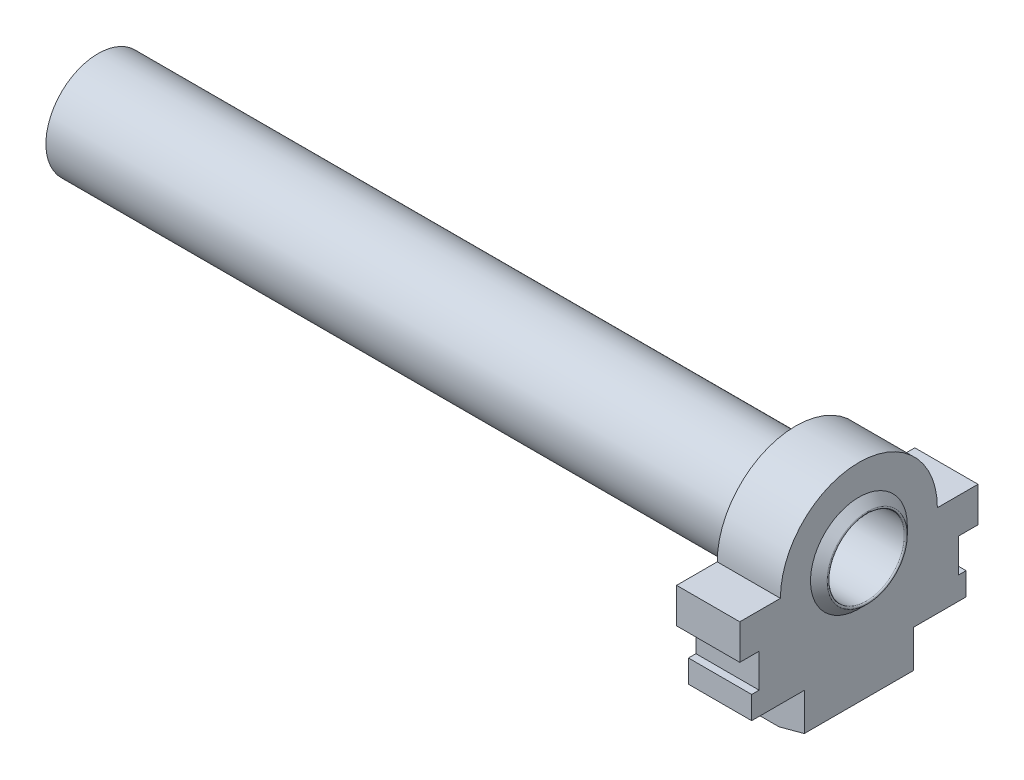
ISO-10303-21;
HEADER;
FILE_DESCRIPTION(('STEP AP214'),'2;1');
FILE_NAME('part.step','',(''),(''),'','','');
FILE_SCHEMA(('AUTOMOTIVE_DESIGN { 1 0 10303 214 1 1 1 1 }'));
ENDSEC;
DATA;
#1=APPLICATION_CONTEXT('core data for automotive mechanical design processes');
#2=APPLICATION_PROTOCOL_DEFINITION('international standard','automotive_design',2000,#1);
#3=PRODUCT_CONTEXT('',#1,'mechanical');
#4=PRODUCT('Part','Part','',(#3));
#5=PRODUCT_RELATED_PRODUCT_CATEGORY('part','',(#4));
#6=PRODUCT_DEFINITION_FORMATION('','',#4);
#7=PRODUCT_DEFINITION_CONTEXT('part definition',#1,'design');
#8=PRODUCT_DEFINITION('design','',#6,#7);
#9=PRODUCT_DEFINITION_SHAPE('','',#8);
#10=(LENGTH_UNIT() NAMED_UNIT(*) SI_UNIT(.MILLI.,.METRE.));
#11=(NAMED_UNIT(*) PLANE_ANGLE_UNIT() SI_UNIT($,.RADIAN.));
#12=(NAMED_UNIT(*) SI_UNIT($,.STERADIAN.) SOLID_ANGLE_UNIT());
#13=UNCERTAINTY_MEASURE_WITH_UNIT(LENGTH_MEASURE(1.E-05),#10,'distance_accuracy_value','');
#14=(GEOMETRIC_REPRESENTATION_CONTEXT(3) GLOBAL_UNCERTAINTY_ASSIGNED_CONTEXT((#13)) GLOBAL_UNIT_ASSIGNED_CONTEXT((#10,
#11,#12)) REPRESENTATION_CONTEXT('',''));
#15=CARTESIAN_POINT('',(0.,0.,0.));
#16=DIRECTION('',(0.,0.,1.));
#17=DIRECTION('',(1.,0.,0.));
#18=AXIS2_PLACEMENT_3D('',#15,#16,#17);
#19=CARTESIAN_POINT('',(77.724,-11.1110638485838,5.4864));
#20=DIRECTION('',(0.,0.,-1.));
#21=DIRECTION('',(-1.,0.,0.));
#22=AXIS2_PLACEMENT_3D('',#19,#20,#21);
#23=PLANE('',#22);
#24=DIRECTION('',(-1.,0.,0.));
#25=VECTOR('',#24,1.);
#26=CARTESIAN_POINT('',(77.724,-15.5560638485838,5.4864));
#27=LINE('',#26,#25);
#28=CARTESIAN_POINT('',(73.914,-15.5560638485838,5.4864));
#29=VERTEX_POINT('',#28);
#30=CARTESIAN_POINT('',(70.104,-15.5560638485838,5.4864));
#31=VERTEX_POINT('',#30);
#32=EDGE_CURVE('E208',#29,#31,#27,.T.);
#33=ORIENTED_EDGE('',*,*,#32,.F.);
#34=DIRECTION('',(0.965925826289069,0.258819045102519,0.));
#35=VECTOR('',#34,1.);
#36=CARTESIAN_POINT('',(76.454,-14.8754728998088,5.48639999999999));
#37=LINE('',#36,#35);
#38=CARTESIAN_POINT('',(76.454,-14.8754728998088,5.4864));
#39=VERTEX_POINT('',#38);
#40=EDGE_CURVE('E11',#29,#39,#37,.T.);
#41=ORIENTED_EDGE('',*,*,#40,.T.);
#42=DIRECTION('',(0.,-1.,0.));
#43=VECTOR('',#42,1.);
#44=CARTESIAN_POINT('',(76.454,0.,5.4864));
#45=LINE('',#44,#43);
#46=CARTESIAN_POINT('',(76.454,-11.1110638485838,5.4864));
#47=VERTEX_POINT('',#46);
#48=EDGE_CURVE('E229',#47,#39,#45,.T.);
#49=ORIENTED_EDGE('',*,*,#48,.F.);
#50=DIRECTION('',(-1.,0.,0.));
#51=VECTOR('',#50,1.);
#52=CARTESIAN_POINT('',(77.724,-11.1110638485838,5.4864));
#53=LINE('',#52,#51);
#54=CARTESIAN_POINT('',(70.104,-11.1110638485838,5.4864));
#55=VERTEX_POINT('',#54);
#56=EDGE_CURVE('E304',#47,#55,#53,.T.);
#57=ORIENTED_EDGE('',*,*,#56,.T.);
#58=DIRECTION('',(0.,-1.,0.));
#59=VECTOR('',#58,1.);
#60=CARTESIAN_POINT('',(70.104,-11.1110638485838,5.4864));
#61=LINE('',#60,#59);
#62=EDGE_CURVE('E301',#55,#31,#61,.T.);
#63=ORIENTED_EDGE('',*,*,#62,.T.);
#64=EDGE_LOOP('',(#33,#41,#49,#57,#63));
#65=FACE_BOUND('',#64,.T.);
#66=ADVANCED_FACE('F33',(#65),#23,.F.);
#67=CARTESIAN_POINT('',(77.724,-15.5560638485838,-5.4864));
#68=DIRECTION('',(0.,1.,0.));
#69=DIRECTION('',(0.,0.,1.));
#70=AXIS2_PLACEMENT_3D('',#67,#68,#69);
#71=PLANE('',#70);
#72=DIRECTION('',(-1.,0.,0.));
#73=VECTOR('',#72,1.);
#74=CARTESIAN_POINT('',(77.724,-15.5560638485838,-5.4864));
#75=LINE('',#74,#73);
#76=CARTESIAN_POINT('',(73.914,-15.5560638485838,-5.4864));
#77=VERTEX_POINT('',#76);
#78=CARTESIAN_POINT('',(70.104,-15.5560638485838,-5.4864));
#79=VERTEX_POINT('',#78);
#80=EDGE_CURVE('E206',#77,#79,#75,.T.);
#81=ORIENTED_EDGE('',*,*,#80,.F.);
#82=DIRECTION('',(0.,0.,1.));
#83=VECTOR('',#82,1.);
#84=CARTESIAN_POINT('',(73.914,-15.5560638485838,5.4864));
#85=LINE('',#84,#83);
#86=EDGE_CURVE('E41',#77,#29,#85,.T.);
#87=ORIENTED_EDGE('',*,*,#86,.T.);
#88=ORIENTED_EDGE('',*,*,#32,.T.);
#89=DIRECTION('',(0.,0.,-1.));
#90=VECTOR('',#89,1.);
#91=CARTESIAN_POINT('',(70.104,-15.5560638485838,-5.4864));
#92=LINE('',#91,#90);
#93=EDGE_CURVE('E298',#31,#79,#92,.T.);
#94=ORIENTED_EDGE('',*,*,#93,.T.);
#95=EDGE_LOOP('',(#81,#87,#88,#94));
#96=FACE_BOUND('',#95,.T.);
#97=ADVANCED_FACE('F374',(#96),#71,.F.);
#98=CARTESIAN_POINT('',(77.724,-11.1110638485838,-5.4864));
#99=DIRECTION('',(0.,0.,1.));
#100=DIRECTION('',(1.,0.,0.));
#101=AXIS2_PLACEMENT_3D('',#98,#99,#100);
#102=PLANE('',#101);
#103=DIRECTION('',(0.,1.,0.));
#104=VECTOR('',#103,1.);
#105=CARTESIAN_POINT('',(76.454,0.,-5.4864));
#106=LINE('',#105,#104);
#107=CARTESIAN_POINT('',(76.454,-14.8754728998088,-5.4864));
#108=VERTEX_POINT('',#107);
#109=CARTESIAN_POINT('',(76.454,-11.1110638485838,-5.4864));
#110=VERTEX_POINT('',#109);
#111=EDGE_CURVE('E226',#108,#110,#106,.T.);
#112=ORIENTED_EDGE('',*,*,#111,.F.);
#113=DIRECTION('',(-0.965925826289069,-0.258819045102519,0.));
#114=VECTOR('',#113,1.);
#115=CARTESIAN_POINT('',(76.454,-14.8754728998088,-5.48639999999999));
#116=LINE('',#115,#114);
#117=EDGE_CURVE('E55',#108,#77,#116,.T.);
#118=ORIENTED_EDGE('',*,*,#117,.T.);
#119=ORIENTED_EDGE('',*,*,#80,.T.);
#120=DIRECTION('',(0.,1.,0.));
#121=VECTOR('',#120,1.);
#122=CARTESIAN_POINT('',(70.104,-11.1110638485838,-5.4864));
#123=LINE('',#122,#121);
#124=CARTESIAN_POINT('',(70.104,-11.1110638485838,-5.4864));
#125=VERTEX_POINT('',#124);
#126=EDGE_CURVE('E296',#79,#125,#123,.T.);
#127=ORIENTED_EDGE('',*,*,#126,.T.);
#128=DIRECTION('',(-1.,0.,0.));
#129=VECTOR('',#128,1.);
#130=CARTESIAN_POINT('',(77.724,-11.1110638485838,-5.4864));
#131=LINE('',#130,#129);
#132=EDGE_CURVE('E204',#110,#125,#131,.T.);
#133=ORIENTED_EDGE('',*,*,#132,.F.);
#134=EDGE_LOOP('',(#112,#118,#119,#127,#133));
#135=FACE_BOUND('',#134,.T.);
#136=ADVANCED_FACE('F233',(#135),#102,.F.);
#137=CARTESIAN_POINT('',(77.724,-11.1110638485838,-10.77595));
#138=DIRECTION('',(0.,1.,0.));
#139=DIRECTION('',(0.,0.,1.));
#140=AXIS2_PLACEMENT_3D('',#137,#138,#139);
#141=PLANE('',#140);
#142=DIRECTION('',(0.,0.,-1.));
#143=VECTOR('',#142,1.);
#144=CARTESIAN_POINT('',(76.454,-11.1110638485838,0.));
#145=LINE('',#144,#143);
#146=CARTESIAN_POINT('',(76.454,-11.1110638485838,-10.77595));
#147=VERTEX_POINT('',#146);
#148=EDGE_CURVE('E235',#110,#147,#145,.T.);
#149=ORIENTED_EDGE('',*,*,#148,.F.);
#150=ORIENTED_EDGE('',*,*,#132,.T.);
#151=DIRECTION('',(0.,0.,-1.));
#152=VECTOR('',#151,1.);
#153=CARTESIAN_POINT('',(70.104,-11.1110638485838,-10.77595));
#154=LINE('',#153,#152);
#155=CARTESIAN_POINT('',(70.104,-11.1110638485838,-10.77595));
#156=VERTEX_POINT('',#155);
#157=EDGE_CURVE('E293',#125,#156,#154,.T.);
#158=ORIENTED_EDGE('',*,*,#157,.T.);
#159=DIRECTION('',(-1.,0.,0.));
#160=VECTOR('',#159,1.);
#161=CARTESIAN_POINT('',(77.724,-11.1110638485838,-10.77595));
#162=LINE('',#161,#160);
#163=EDGE_CURVE('E202',#147,#156,#162,.T.);
#164=ORIENTED_EDGE('',*,*,#163,.F.);
#165=EDGE_LOOP('',(#149,#150,#158,#164));
#166=FACE_BOUND('',#165,.T.);
#167=ADVANCED_FACE('F583',(#166),#141,.F.);
#168=CARTESIAN_POINT('',(77.724,-11.1110638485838,-10.77595));
#169=DIRECTION('',(0.,0.,1.));
#170=DIRECTION('',(1.,0.,0.));
#171=AXIS2_PLACEMENT_3D('',#168,#169,#170);
#172=PLANE('',#171);
#173=DIRECTION('',(0.,1.,0.));
#174=VECTOR('',#173,1.);
#175=CARTESIAN_POINT('',(76.454,0.,-10.77595));
#176=LINE('',#175,#174);
#177=CARTESIAN_POINT('',(76.454,-8.82506384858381,-10.77595));
#178=VERTEX_POINT('',#177);
#179=EDGE_CURVE('E237',#147,#178,#176,.T.);
#180=ORIENTED_EDGE('',*,*,#179,.F.);
#181=ORIENTED_EDGE('',*,*,#163,.T.);
#182=DIRECTION('',(0.,1.,0.));
#183=VECTOR('',#182,1.);
#184=CARTESIAN_POINT('',(70.104,-11.1110638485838,-10.77595));
#185=LINE('',#184,#183);
#186=CARTESIAN_POINT('',(70.104,-8.82506384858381,-10.77595));
#187=VERTEX_POINT('',#186);
#188=EDGE_CURVE('E290',#156,#187,#185,.T.);
#189=ORIENTED_EDGE('',*,*,#188,.T.);
#190=DIRECTION('',(-1.,0.,0.));
#191=VECTOR('',#190,1.);
#192=CARTESIAN_POINT('',(77.724,-8.82506384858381,-10.77595));
#193=LINE('',#192,#191);
#194=EDGE_CURVE('E200',#178,#187,#193,.T.);
#195=ORIENTED_EDGE('',*,*,#194,.F.);
#196=EDGE_LOOP('',(#180,#181,#189,#195));
#197=FACE_BOUND('',#196,.T.);
#198=ADVANCED_FACE('F574',(#197),#172,.F.);
#199=CARTESIAN_POINT('',(77.724,-8.82506384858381,-10.77595));
#200=DIRECTION('',(0.,-1.,0.));
#201=DIRECTION('',(0.,0.,-1.));
#202=AXIS2_PLACEMENT_3D('',#199,#200,#201);
#203=PLANE('',#202);
#204=DIRECTION('',(0.,0.,1.));
#205=VECTOR('',#204,1.);
#206=CARTESIAN_POINT('',(76.454,-8.82506384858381,0.));
#207=LINE('',#206,#205);
#208=CARTESIAN_POINT('',(76.454,-8.82506384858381,-10.0274649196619));
#209=VERTEX_POINT('',#208);
#210=EDGE_CURVE('E244',#178,#209,#207,.T.);
#211=ORIENTED_EDGE('',*,*,#210,.F.);
#212=ORIENTED_EDGE('',*,*,#194,.T.);
#213=DIRECTION('',(0.,0.,1.));
#214=VECTOR('',#213,1.);
#215=CARTESIAN_POINT('',(70.104,-8.82506384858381,-10.77595));
#216=LINE('',#215,#214);
#217=CARTESIAN_POINT('',(70.104,-8.82506384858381,-10.0274649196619));
#218=VERTEX_POINT('',#217);
#219=EDGE_CURVE('E287',#187,#218,#216,.T.);
#220=ORIENTED_EDGE('',*,*,#219,.T.);
#221=DIRECTION('',(-1.,0.,0.));
#222=VECTOR('',#221,1.);
#223=CARTESIAN_POINT('',(77.724,-8.82506384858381,-10.0274649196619));
#224=LINE('',#223,#222);
#225=EDGE_CURVE('E198',#209,#218,#224,.T.);
#226=ORIENTED_EDGE('',*,*,#225,.F.);
#227=EDGE_LOOP('',(#211,#212,#220,#226));
#228=FACE_BOUND('',#227,.T.);
#229=ADVANCED_FACE('F565',(#228),#203,.F.);
#230=CARTESIAN_POINT('',(77.724,-8.82506384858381,-10.0274649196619));
#231=DIRECTION('',(0.,0.,1.));
#232=DIRECTION('',(1.,0.,0.));
#233=AXIS2_PLACEMENT_3D('',#230,#231,#232);
#234=PLANE('',#233);
#235=DIRECTION('',(0.,1.,0.));
#236=VECTOR('',#235,1.);
#237=CARTESIAN_POINT('',(76.454,0.,-10.0274649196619));
#238=LINE('',#237,#236);
#239=CARTESIAN_POINT('',(76.454,-5.43416384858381,-10.0274649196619));
#240=VERTEX_POINT('',#239);
#241=EDGE_CURVE('E246',#209,#240,#238,.T.);
#242=ORIENTED_EDGE('',*,*,#241,.F.);
#243=ORIENTED_EDGE('',*,*,#225,.T.);
#244=DIRECTION('',(0.,1.,0.));
#245=VECTOR('',#244,1.);
#246=CARTESIAN_POINT('',(70.104,-8.82506384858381,-10.0274649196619));
#247=LINE('',#246,#245);
#248=CARTESIAN_POINT('',(70.104,-5.43416384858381,-10.0274649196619));
#249=VERTEX_POINT('',#248);
#250=EDGE_CURVE('E284',#218,#249,#247,.T.);
#251=ORIENTED_EDGE('',*,*,#250,.T.);
#252=DIRECTION('',(-1.,0.,0.));
#253=VECTOR('',#252,1.);
#254=CARTESIAN_POINT('',(77.724,-5.43416384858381,-10.0274649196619));
#255=LINE('',#254,#253);
#256=EDGE_CURVE('E196',#240,#249,#255,.T.);
#257=ORIENTED_EDGE('',*,*,#256,.F.);
#258=EDGE_LOOP('',(#242,#243,#251,#257));
#259=FACE_BOUND('',#258,.T.);
#260=ADVANCED_FACE('F556',(#259),#234,.F.);
#261=CARTESIAN_POINT('',(77.724,-5.43416384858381,-11.96975));
#262=DIRECTION('',(0.,1.,0.));
#263=DIRECTION('',(0.,0.,1.));
#264=AXIS2_PLACEMENT_3D('',#261,#262,#263);
#265=PLANE('',#264);
#266=DIRECTION('',(0.,0.,-1.));
#267=VECTOR('',#266,1.);
#268=CARTESIAN_POINT('',(76.454,-5.43416384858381,0.));
#269=LINE('',#268,#267);
#270=CARTESIAN_POINT('',(76.454,-5.43416384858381,-11.96975));
#271=VERTEX_POINT('',#270);
#272=EDGE_CURVE('E248',#240,#271,#269,.T.);
#273=ORIENTED_EDGE('',*,*,#272,.F.);
#274=ORIENTED_EDGE('',*,*,#256,.T.);
#275=DIRECTION('',(0.,0.,-1.));
#276=VECTOR('',#275,1.);
#277=CARTESIAN_POINT('',(70.104,-5.43416384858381,-11.96975));
#278=LINE('',#277,#276);
#279=CARTESIAN_POINT('',(70.104,-5.43416384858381,-11.96975));
#280=VERTEX_POINT('',#279);
#281=EDGE_CURVE('E281',#249,#280,#278,.T.);
#282=ORIENTED_EDGE('',*,*,#281,.T.);
#283=DIRECTION('',(-1.,0.,0.));
#284=VECTOR('',#283,1.);
#285=CARTESIAN_POINT('',(77.724,-5.43416384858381,-11.96975));
#286=LINE('',#285,#284);
#287=EDGE_CURVE('E189',#271,#280,#286,.T.);
#288=ORIENTED_EDGE('',*,*,#287,.F.);
#289=EDGE_LOOP('',(#273,#274,#282,#288));
#290=FACE_BOUND('',#289,.T.);
#291=ADVANCED_FACE('F547',(#290),#265,.F.);
#292=CARTESIAN_POINT('',(77.724,-1.90356384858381,-11.96975));
#293=DIRECTION('',(0.,0.,1.));
#294=DIRECTION('',(1.,0.,0.));
#295=AXIS2_PLACEMENT_3D('',#292,#293,#294);
#296=PLANE('',#295);
#297=DIRECTION('',(0.,1.,0.));
#298=VECTOR('',#297,1.);
#299=CARTESIAN_POINT('',(76.454,0.,-11.96975));
#300=LINE('',#299,#298);
#301=CARTESIAN_POINT('',(76.454,-1.90356384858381,-11.96975));
#302=VERTEX_POINT('',#301);
#303=EDGE_CURVE('E168',#271,#302,#300,.T.);
#304=ORIENTED_EDGE('',*,*,#303,.F.);
#305=ORIENTED_EDGE('',*,*,#287,.T.);
#306=DIRECTION('',(0.,1.,0.));
#307=VECTOR('',#306,1.);
#308=CARTESIAN_POINT('',(70.104,-1.90356384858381,-11.96975));
#309=LINE('',#308,#307);
#310=CARTESIAN_POINT('',(70.104,-1.90356384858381,-11.96975));
#311=VERTEX_POINT('',#310);
#312=EDGE_CURVE('E278',#280,#311,#309,.T.);
#313=ORIENTED_EDGE('',*,*,#312,.T.);
#314=DIRECTION('',(-1.,0.,0.));
#315=VECTOR('',#314,1.);
#316=CARTESIAN_POINT('',(77.724,-1.90356384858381,-11.96975));
#317=LINE('',#316,#315);
#318=EDGE_CURVE('E187',#302,#311,#317,.T.);
#319=ORIENTED_EDGE('',*,*,#318,.F.);
#320=EDGE_LOOP('',(#304,#305,#313,#319));
#321=FACE_BOUND('',#320,.T.);
#322=ADVANCED_FACE('F539',(#321),#296,.F.);
#323=CARTESIAN_POINT('',(77.724,-1.90356384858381,-7.8867));
#324=DIRECTION('',(0.,-1.,0.));
#325=DIRECTION('',(0.,0.,-1.));
#326=AXIS2_PLACEMENT_3D('',#323,#324,#325);
#327=PLANE('',#326);
#328=DIRECTION('',(0.,0.,1.));
#329=VECTOR('',#328,1.);
#330=CARTESIAN_POINT('',(76.454,-1.90356384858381,0.));
#331=LINE('',#330,#329);
#332=CARTESIAN_POINT('',(76.454,-1.90356384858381,-7.8867));
#333=VERTEX_POINT('',#332);
#334=EDGE_CURVE('E161',#302,#333,#331,.T.);
#335=ORIENTED_EDGE('',*,*,#334,.F.);
#336=ORIENTED_EDGE('',*,*,#318,.T.);
#337=DIRECTION('',(0.,0.,1.));
#338=VECTOR('',#337,1.);
#339=CARTESIAN_POINT('',(70.104,-1.90356384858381,-7.8867));
#340=LINE('',#339,#338);
#341=CARTESIAN_POINT('',(70.104,-1.90356384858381,-7.8867));
#342=VERTEX_POINT('',#341);
#343=EDGE_CURVE('E186',#311,#342,#340,.T.);
#344=ORIENTED_EDGE('',*,*,#343,.T.);
#345=DIRECTION('',(-1.,0.,0.));
#346=VECTOR('',#345,1.);
#347=CARTESIAN_POINT('',(77.724,-1.90356384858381,-7.8867));
#348=LINE('',#347,#346);
#349=EDGE_CURVE('E178',#333,#342,#348,.T.);
#350=ORIENTED_EDGE('',*,*,#349,.F.);
#351=EDGE_LOOP('',(#335,#336,#344,#350));
#352=FACE_BOUND('',#351,.T.);
#353=ADVANCED_FACE('F184',(#352),#327,.F.);
#354=CARTESIAN_POINT('',(77.724,-1.90356384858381,0.));
#355=DIRECTION('',(-1.,0.,0.));
#356=DIRECTION('',(0.,0.,1.));
#357=AXIS2_PLACEMENT_3D('',#354,#355,#356);
#358=CYLINDRICAL_SURFACE('',#357,7.8867);
#359=CARTESIAN_POINT('',(76.454,-1.90356384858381,0.));
#360=DIRECTION('',(1.,0.,0.));
#361=DIRECTION('',(0.,0.,-1.));
#362=AXIS2_PLACEMENT_3D('',#359,#360,#361);
#363=CIRCLE('',#362,7.8867);
#364=CARTESIAN_POINT('',(76.454,-1.90356384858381,7.88669999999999));
#365=VERTEX_POINT('',#364);
#366=EDGE_CURVE('E165',#333,#365,#363,.T.);
#367=ORIENTED_EDGE('',*,*,#366,.F.);
#368=ORIENTED_EDGE('',*,*,#349,.T.);
#369=CARTESIAN_POINT('',(70.104,-1.90356384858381,0.));
#370=DIRECTION('',(1.,0.,0.));
#371=DIRECTION('',(0.,0.,-1.));
#372=AXIS2_PLACEMENT_3D('',#369,#370,#371);
#373=CIRCLE('',#372,7.8867);
#374=CARTESIAN_POINT('',(70.104,-1.90356384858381,7.8867));
#375=VERTEX_POINT('',#374);
#376=EDGE_CURVE('E275',#342,#375,#373,.T.);
#377=ORIENTED_EDGE('',*,*,#376,.T.);
#378=DIRECTION('',(-1.,0.,0.));
#379=VECTOR('',#378,1.);
#380=CARTESIAN_POINT('',(77.724,-1.90356384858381,7.8867));
#381=LINE('',#380,#379);
#382=EDGE_CURVE('E180',#365,#375,#381,.T.);
#383=ORIENTED_EDGE('',*,*,#382,.F.);
#384=EDGE_LOOP('',(#367,#368,#377,#383));
#385=FACE_BOUND('',#384,.T.);
#386=ADVANCED_FACE('F176',(#385),#358,.T.);
#387=CARTESIAN_POINT('',(77.724,-1.90356384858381,7.8867));
#388=DIRECTION('',(0.,-1.,0.));
#389=DIRECTION('',(0.,0.,-1.));
#390=AXIS2_PLACEMENT_3D('',#387,#388,#389);
#391=PLANE('',#390);
#392=DIRECTION('',(0.,0.,1.));
#393=VECTOR('',#392,1.);
#394=CARTESIAN_POINT('',(76.454,-1.9035638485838,0.));
#395=LINE('',#394,#393);
#396=CARTESIAN_POINT('',(76.454,-1.90356384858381,11.96975));
#397=VERTEX_POINT('',#396);
#398=EDGE_CURVE('E181',#365,#397,#395,.T.);
#399=ORIENTED_EDGE('',*,*,#398,.F.);
#400=ORIENTED_EDGE('',*,*,#382,.T.);
#401=DIRECTION('',(0.,0.,1.));
#402=VECTOR('',#401,1.);
#403=CARTESIAN_POINT('',(70.104,-1.90356384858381,7.8867));
#404=LINE('',#403,#402);
#405=CARTESIAN_POINT('',(70.104,-1.90356384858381,11.96975));
#406=VERTEX_POINT('',#405);
#407=EDGE_CURVE('E272',#375,#406,#404,.T.);
#408=ORIENTED_EDGE('',*,*,#407,.T.);
#409=DIRECTION('',(-1.,0.,0.));
#410=VECTOR('',#409,1.);
#411=CARTESIAN_POINT('',(77.724,-1.90356384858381,11.96975));
#412=LINE('',#411,#410);
#413=EDGE_CURVE('E191',#397,#406,#412,.T.);
#414=ORIENTED_EDGE('',*,*,#413,.F.);
#415=EDGE_LOOP('',(#399,#400,#408,#414));
#416=FACE_BOUND('',#415,.T.);
#417=ADVANCED_FACE('F329',(#416),#391,.F.);
#418=CARTESIAN_POINT('',(77.724,-1.90356384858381,11.96975));
#419=DIRECTION('',(0.,0.,-1.));
#420=DIRECTION('',(-1.,0.,0.));
#421=AXIS2_PLACEMENT_3D('',#418,#419,#420);
#422=PLANE('',#421);
#423=DIRECTION('',(0.,-1.,0.));
#424=VECTOR('',#423,1.);
#425=CARTESIAN_POINT('',(76.454,0.,11.96975));
#426=LINE('',#425,#424);
#427=CARTESIAN_POINT('',(76.454,-5.43416384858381,11.96975));
#428=VERTEX_POINT('',#427);
#429=EDGE_CURVE('E321',#397,#428,#426,.T.);
#430=ORIENTED_EDGE('',*,*,#429,.F.);
#431=ORIENTED_EDGE('',*,*,#413,.T.);
#432=DIRECTION('',(0.,-1.,0.));
#433=VECTOR('',#432,1.);
#434=CARTESIAN_POINT('',(70.104,-1.90356384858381,11.96975));
#435=LINE('',#434,#433);
#436=CARTESIAN_POINT('',(70.104,-5.43416384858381,11.96975));
#437=VERTEX_POINT('',#436);
#438=EDGE_CURVE('E269',#406,#437,#435,.T.);
#439=ORIENTED_EDGE('',*,*,#438,.T.);
#440=DIRECTION('',(-1.,0.,0.));
#441=VECTOR('',#440,1.);
#442=CARTESIAN_POINT('',(77.724,-5.43416384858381,11.96975));
#443=LINE('',#442,#441);
#444=EDGE_CURVE('E314',#428,#437,#443,.T.);
#445=ORIENTED_EDGE('',*,*,#444,.F.);
#446=EDGE_LOOP('',(#430,#431,#439,#445));
#447=FACE_BOUND('',#446,.T.);
#448=ADVANCED_FACE('F319',(#447),#422,.F.);
#449=CARTESIAN_POINT('',(77.724,-5.43416384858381,11.96975));
#450=DIRECTION('',(0.,1.,0.));
#451=DIRECTION('',(0.,0.,1.));
#452=AXIS2_PLACEMENT_3D('',#449,#450,#451);
#453=PLANE('',#452);
#454=DIRECTION('',(0.,0.,-1.));
#455=VECTOR('',#454,1.);
#456=CARTESIAN_POINT('',(76.454,-5.43416384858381,0.));
#457=LINE('',#456,#455);
#458=CARTESIAN_POINT('',(76.454,-5.43416384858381,10.0274649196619));
#459=VERTEX_POINT('',#458);
#460=EDGE_CURVE('E331',#428,#459,#457,.T.);
#461=ORIENTED_EDGE('',*,*,#460,.F.);
#462=ORIENTED_EDGE('',*,*,#444,.T.);
#463=DIRECTION('',(0.,0.,-1.));
#464=VECTOR('',#463,1.);
#465=CARTESIAN_POINT('',(70.104,-5.43416384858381,11.96975));
#466=LINE('',#465,#464);
#467=CARTESIAN_POINT('',(70.104,-5.43416384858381,10.0274649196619));
#468=VERTEX_POINT('',#467);
#469=EDGE_CURVE('E266',#437,#468,#466,.T.);
#470=ORIENTED_EDGE('',*,*,#469,.T.);
#471=DIRECTION('',(-1.,0.,0.));
#472=VECTOR('',#471,1.);
#473=CARTESIAN_POINT('',(77.724,-5.43416384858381,10.0274649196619));
#474=LINE('',#473,#472);
#475=EDGE_CURVE('E312',#459,#468,#474,.T.);
#476=ORIENTED_EDGE('',*,*,#475,.F.);
#477=EDGE_LOOP('',(#461,#462,#470,#476));
#478=FACE_BOUND('',#477,.T.);
#479=ADVANCED_FACE('F364',(#478),#453,.F.);
#480=CARTESIAN_POINT('',(77.724,-8.82506384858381,10.0274649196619));
#481=DIRECTION('',(0.,0.,-1.));
#482=DIRECTION('',(-1.,0.,0.));
#483=AXIS2_PLACEMENT_3D('',#480,#481,#482);
#484=PLANE('',#483);
#485=DIRECTION('',(0.,-1.,0.));
#486=VECTOR('',#485,1.);
#487=CARTESIAN_POINT('',(76.454,0.,10.0274649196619));
#488=LINE('',#487,#486);
#489=CARTESIAN_POINT('',(76.454,-8.82506384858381,10.0274649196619));
#490=VERTEX_POINT('',#489);
#491=EDGE_CURVE('E335',#459,#490,#488,.T.);
#492=ORIENTED_EDGE('',*,*,#491,.F.);
#493=ORIENTED_EDGE('',*,*,#475,.T.);
#494=DIRECTION('',(0.,-1.,0.));
#495=VECTOR('',#494,1.);
#496=CARTESIAN_POINT('',(70.104,-8.82506384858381,10.0274649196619));
#497=LINE('',#496,#495);
#498=CARTESIAN_POINT('',(70.104,-8.82506384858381,10.0274649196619));
#499=VERTEX_POINT('',#498);
#500=EDGE_CURVE('E263',#468,#499,#497,.T.);
#501=ORIENTED_EDGE('',*,*,#500,.T.);
#502=DIRECTION('',(-1.,0.,0.));
#503=VECTOR('',#502,1.);
#504=CARTESIAN_POINT('',(77.724,-8.82506384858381,10.0274649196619));
#505=LINE('',#504,#503);
#506=EDGE_CURVE('E310',#490,#499,#505,.T.);
#507=ORIENTED_EDGE('',*,*,#506,.F.);
#508=EDGE_LOOP('',(#492,#493,#501,#507));
#509=FACE_BOUND('',#508,.T.);
#510=ADVANCED_FACE('F360',(#509),#484,.F.);
#511=CARTESIAN_POINT('',(77.724,-8.82506384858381,10.77595));
#512=DIRECTION('',(0.,-1.,0.));
#513=DIRECTION('',(0.,0.,-1.));
#514=AXIS2_PLACEMENT_3D('',#511,#512,#513);
#515=PLANE('',#514);
#516=DIRECTION('',(0.,0.,1.));
#517=VECTOR('',#516,1.);
#518=CARTESIAN_POINT('',(76.454,-8.82506384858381,0.));
#519=LINE('',#518,#517);
#520=CARTESIAN_POINT('',(76.454,-8.82506384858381,10.77595));
#521=VERTEX_POINT('',#520);
#522=EDGE_CURVE('E337',#490,#521,#519,.T.);
#523=ORIENTED_EDGE('',*,*,#522,.F.);
#524=ORIENTED_EDGE('',*,*,#506,.T.);
#525=DIRECTION('',(0.,0.,1.));
#526=VECTOR('',#525,1.);
#527=CARTESIAN_POINT('',(70.104,-8.82506384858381,10.77595));
#528=LINE('',#527,#526);
#529=CARTESIAN_POINT('',(70.104,-8.82506384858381,10.77595));
#530=VERTEX_POINT('',#529);
#531=EDGE_CURVE('E260',#499,#530,#528,.T.);
#532=ORIENTED_EDGE('',*,*,#531,.T.);
#533=DIRECTION('',(-1.,0.,0.));
#534=VECTOR('',#533,1.);
#535=CARTESIAN_POINT('',(77.724,-8.82506384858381,10.77595));
#536=LINE('',#535,#534);
#537=EDGE_CURVE('E308',#521,#530,#536,.T.);
#538=ORIENTED_EDGE('',*,*,#537,.F.);
#539=EDGE_LOOP('',(#523,#524,#532,#538));
#540=FACE_BOUND('',#539,.T.);
#541=ADVANCED_FACE('F356',(#540),#515,.F.);
#542=CARTESIAN_POINT('',(77.724,-11.1110638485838,10.77595));
#543=DIRECTION('',(0.,0.,-1.));
#544=DIRECTION('',(-1.,0.,0.));
#545=AXIS2_PLACEMENT_3D('',#542,#543,#544);
#546=PLANE('',#545);
#547=DIRECTION('',(0.,-1.,0.));
#548=VECTOR('',#547,1.);
#549=CARTESIAN_POINT('',(76.454,0.,10.77595));
#550=LINE('',#549,#548);
#551=CARTESIAN_POINT('',(76.454,-11.1110638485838,10.77595));
#552=VERTEX_POINT('',#551);
#553=EDGE_CURVE('E339',#521,#552,#550,.T.);
#554=ORIENTED_EDGE('',*,*,#553,.F.);
#555=ORIENTED_EDGE('',*,*,#537,.T.);
#556=DIRECTION('',(0.,-1.,0.));
#557=VECTOR('',#556,1.);
#558=CARTESIAN_POINT('',(70.104,-11.1110638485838,10.77595));
#559=LINE('',#558,#557);
#560=CARTESIAN_POINT('',(70.104,-11.1110638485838,10.77595));
#561=VERTEX_POINT('',#560);
#562=EDGE_CURVE('E255',#530,#561,#559,.T.);
#563=ORIENTED_EDGE('',*,*,#562,.T.);
#564=DIRECTION('',(-1.,0.,0.));
#565=VECTOR('',#564,1.);
#566=CARTESIAN_POINT('',(77.724,-11.1110638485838,10.77595));
#567=LINE('',#566,#565);
#568=EDGE_CURVE('E306',#552,#561,#567,.T.);
#569=ORIENTED_EDGE('',*,*,#568,.F.);
#570=EDGE_LOOP('',(#554,#555,#563,#569));
#571=FACE_BOUND('',#570,.T.);
#572=ADVANCED_FACE('F352',(#571),#546,.F.);
#573=CARTESIAN_POINT('',(77.724,-11.1110638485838,10.77595));
#574=DIRECTION('',(0.,1.,0.));
#575=DIRECTION('',(0.,0.,1.));
#576=AXIS2_PLACEMENT_3D('',#573,#574,#575);
#577=PLANE('',#576);
#578=DIRECTION('',(0.,0.,-1.));
#579=VECTOR('',#578,1.);
#580=CARTESIAN_POINT('',(76.454,-11.1110638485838,0.));
#581=LINE('',#580,#579);
#582=EDGE_CURVE('E239',#552,#47,#581,.T.);
#583=ORIENTED_EDGE('',*,*,#582,.F.);
#584=ORIENTED_EDGE('',*,*,#568,.T.);
#585=DIRECTION('',(0.,0.,-1.));
#586=VECTOR('',#585,1.);
#587=CARTESIAN_POINT('',(70.104,-11.1110638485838,10.77595));
#588=LINE('',#587,#586);
#589=EDGE_CURVE('E213',#561,#55,#588,.T.);
#590=ORIENTED_EDGE('',*,*,#589,.T.);
#591=ORIENTED_EDGE('',*,*,#56,.F.);
#592=EDGE_LOOP('',(#583,#584,#590,#591));
#593=FACE_BOUND('',#592,.T.);
#594=ADVANCED_FACE('F347',(#593),#577,.F.);
#595=CARTESIAN_POINT('',(70.104,0.,0.));
#596=DIRECTION('',(1.,0.,0.));
#597=DIRECTION('',(0.,0.,-1.));
#598=AXIS2_PLACEMENT_3D('',#595,#596,#597);
#599=PLANE('',#598);
#600=CARTESIAN_POINT('',(70.104,-1.90356384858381,0.));
#601=DIRECTION('',(1.,0.,0.));
#602=DIRECTION('',(0.,0.,-1.));
#603=AXIS2_PLACEMENT_3D('',#600,#601,#602);
#604=CIRCLE('',#603,5.2451);
#605=CARTESIAN_POINT('',(70.104,-1.90356384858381,-5.2451));
#606=VERTEX_POINT('',#605);
#607=EDGE_CURVE('E252',#606,#606,#604,.T.);
#608=ORIENTED_EDGE('',*,*,#607,.T.);
#609=EDGE_LOOP('',(#608));
#610=FACE_BOUND('',#609,.T.);
#611=ORIENTED_EDGE('',*,*,#589,.F.);
#612=ORIENTED_EDGE('',*,*,#562,.F.);
#613=ORIENTED_EDGE('',*,*,#531,.F.);
#614=ORIENTED_EDGE('',*,*,#500,.F.);
#615=ORIENTED_EDGE('',*,*,#469,.F.);
#616=ORIENTED_EDGE('',*,*,#438,.F.);
#617=ORIENTED_EDGE('',*,*,#407,.F.);
#618=ORIENTED_EDGE('',*,*,#376,.F.);
#619=ORIENTED_EDGE('',*,*,#343,.F.);
#620=ORIENTED_EDGE('',*,*,#312,.F.);
#621=ORIENTED_EDGE('',*,*,#281,.F.);
#622=ORIENTED_EDGE('',*,*,#250,.F.);
#623=ORIENTED_EDGE('',*,*,#219,.F.);
#624=ORIENTED_EDGE('',*,*,#188,.F.);
#625=ORIENTED_EDGE('',*,*,#157,.F.);
#626=ORIENTED_EDGE('',*,*,#126,.F.);
#627=ORIENTED_EDGE('',*,*,#93,.F.);
#628=ORIENTED_EDGE('',*,*,#62,.F.);
#629=EDGE_LOOP('',(#611,#612,#613,#614,#615,#616,#617,#618,#619,#620,#621,#622,#623,#624,#625,
#626,#627,#628));
#630=FACE_BOUND('',#629,.T.);
#631=ADVANCED_FACE('F327',(#610,#630),#599,.F.);
#632=CARTESIAN_POINT('',(70.104,-1.90356384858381,0.));
#633=DIRECTION('',(-1.,0.,0.));
#634=DIRECTION('',(0.,0.,1.));
#635=AXIS2_PLACEMENT_3D('',#632,#633,#634);
#636=CYLINDRICAL_SURFACE('',#635,5.2451);
#637=ORIENTED_EDGE('',*,*,#607,.F.);
#638=EDGE_LOOP('',(#637));
#639=FACE_BOUND('',#638,.T.);
#640=CARTESIAN_POINT('',(0.,-1.90356384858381,0.));
#641=DIRECTION('',(1.,0.,0.));
#642=DIRECTION('',(0.,0.,-1.));
#643=AXIS2_PLACEMENT_3D('',#640,#641,#642);
#644=CIRCLE('',#643,5.2451);
#645=CARTESIAN_POINT('',(0.,-1.90356384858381,-5.2451));
#646=VERTEX_POINT('',#645);
#647=EDGE_CURVE('E251',#646,#646,#644,.T.);
#648=ORIENTED_EDGE('',*,*,#647,.T.);
#649=EDGE_LOOP('',(#648));
#650=FACE_BOUND('',#649,.T.);
#651=ADVANCED_FACE('F411',(#639,#650),#636,.T.);
#652=CARTESIAN_POINT('',(0.,-1.90356384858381,0.));
#653=DIRECTION('',(1.,0.,0.));
#654=DIRECTION('',(0.,0.,-1.));
#655=AXIS2_PLACEMENT_3D('',#652,#653,#654);
#656=PLANE('',#655);
#657=ORIENTED_EDGE('',*,*,#647,.F.);
#658=EDGE_LOOP('',(#657));
#659=FACE_BOUND('',#658,.T.);
#660=ADVANCED_FACE('F407',(#659),#656,.F.);
#661=CARTESIAN_POINT('',(76.454,0.,0.));
#662=DIRECTION('',(1.,0.,0.));
#663=DIRECTION('',(0.,0.,-1.));
#664=AXIS2_PLACEMENT_3D('',#661,#662,#663);
#665=PLANE('',#664);
#666=CARTESIAN_POINT('',(76.454,-1.90356384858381,0.));
#667=DIRECTION('',(1.,0.,0.));
#668=DIRECTION('',(0.,0.,-1.));
#669=AXIS2_PLACEMENT_3D('',#666,#667,#668);
#670=CIRCLE('',#669,4.86224943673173);
#671=CARTESIAN_POINT('',(76.454,-1.90356384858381,-4.86224943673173));
#672=VERTEX_POINT('',#671);
#673=EDGE_CURVE('E172',#672,#672,#670,.T.);
#674=ORIENTED_EDGE('',*,*,#673,.F.);
#675=EDGE_LOOP('',(#674));
#676=FACE_BOUND('',#675,.T.);
#677=ORIENTED_EDGE('',*,*,#48,.T.);
#678=DIRECTION('',(0.,0.,-1.));
#679=VECTOR('',#678,1.);
#680=CARTESIAN_POINT('',(76.454,-14.8754728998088,-5.4864));
#681=LINE('',#680,#679);
#682=EDGE_CURVE('E222',#39,#108,#681,.T.);
#683=ORIENTED_EDGE('',*,*,#682,.T.);
#684=ORIENTED_EDGE('',*,*,#111,.T.);
#685=ORIENTED_EDGE('',*,*,#148,.T.);
#686=ORIENTED_EDGE('',*,*,#179,.T.);
#687=ORIENTED_EDGE('',*,*,#210,.T.);
#688=ORIENTED_EDGE('',*,*,#241,.T.);
#689=ORIENTED_EDGE('',*,*,#272,.T.);
#690=ORIENTED_EDGE('',*,*,#303,.T.);
#691=ORIENTED_EDGE('',*,*,#334,.T.);
#692=ORIENTED_EDGE('',*,*,#366,.T.);
#693=ORIENTED_EDGE('',*,*,#398,.T.);
#694=ORIENTED_EDGE('',*,*,#429,.T.);
#695=ORIENTED_EDGE('',*,*,#460,.T.);
#696=ORIENTED_EDGE('',*,*,#491,.T.);
#697=ORIENTED_EDGE('',*,*,#522,.T.);
#698=ORIENTED_EDGE('',*,*,#553,.T.);
#699=ORIENTED_EDGE('',*,*,#582,.T.);
#700=EDGE_LOOP('',(#677,#683,#684,#685,#686,#687,#688,#689,#690,#691,#692,#693,#694,#695,#696,
#697,#698,#699));
#701=FACE_BOUND('',#700,.T.);
#702=ADVANCED_FACE('F164',(#676,#701),#665,.T.);
#703=CARTESIAN_POINT('',(6.35,-1.90356384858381,0.));
#704=DIRECTION('',(1.,0.,0.));
#705=DIRECTION('',(0.,0.,-1.));
#706=AXIS2_PLACEMENT_3D('',#703,#704,#705);
#707=PLANE('',#706);
#708=CARTESIAN_POINT('',(6.34999999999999,-1.90356384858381,0.));
#709=DIRECTION('',(1.,0.,0.));
#710=DIRECTION('',(0.,0.,-1.));
#711=AXIS2_PLACEMENT_3D('',#708,#709,#710);
#712=CIRCLE('',#711,3.81);
#713=CARTESIAN_POINT('',(6.34999999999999,-1.90356384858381,3.81));
#714=VERTEX_POINT('',#713);
#715=EDGE_CURVE('E210',#714,#714,#712,.T.);
#716=ORIENTED_EDGE('',*,*,#715,.T.);
#717=EDGE_LOOP('',(#716));
#718=FACE_BOUND('',#717,.T.);
#719=ADVANCED_FACE('F398',(#718),#707,.T.);
#720=CARTESIAN_POINT('',(77.724,-1.90356384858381,0.));
#721=DIRECTION('',(-1.,0.,0.));
#722=DIRECTION('',(0.,0.,1.));
#723=AXIS2_PLACEMENT_3D('',#720,#721,#722);
#724=CYLINDRICAL_SURFACE('',#723,3.81);
#725=CARTESIAN_POINT('',(77.1996443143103,-1.90356384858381,0.));
#726=DIRECTION('',(-1.,0.,0.));
#727=DIRECTION('',(0.,0.,1.));
#728=AXIS2_PLACEMENT_3D('',#725,#726,#727);
#729=CIRCLE('',#728,3.81);
#730=CARTESIAN_POINT('',(77.1996443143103,-1.90356384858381,3.81));
#731=VERTEX_POINT('',#730);
#732=EDGE_CURVE('E216',#731,#731,#729,.F.);
#733=CARTESIAN_POINT('',(77.1996443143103,-1.90356384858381,3.81));
#734=CARTESIAN_POINT('',(76.4616271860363,-1.90356384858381,3.81));
#735=CARTESIAN_POINT('',(75.7236100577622,-1.90356384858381,3.81));
#736=CARTESIAN_POINT('',(74.2475758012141,-1.90356384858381,3.81));
#737=CARTESIAN_POINT('',(73.50955867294,-1.90356384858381,3.81));
#738=CARTESIAN_POINT('',(72.0335244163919,-1.90356384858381,3.81));
#739=CARTESIAN_POINT('',(71.2955072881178,-1.90356384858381,3.81));
#740=CARTESIAN_POINT('',(69.8194730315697,-1.90356384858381,3.81));
#741=CARTESIAN_POINT('',(69.0814559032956,-1.90356384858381,3.81));
#742=CARTESIAN_POINT('',(67.6054216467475,-1.90356384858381,3.81));
#743=CARTESIAN_POINT('',(66.8674045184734,-1.90356384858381,3.81));
#744=CARTESIAN_POINT('',(65.3913702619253,-1.90356384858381,3.81));
#745=CARTESIAN_POINT('',(64.6533531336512,-1.90356384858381,3.81));
#746=CARTESIAN_POINT('',(63.1773188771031,-1.90356384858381,3.81));
#747=CARTESIAN_POINT('',(62.439301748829,-1.90356384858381,3.81));
#748=CARTESIAN_POINT('',(60.9632674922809,-1.90356384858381,3.81));
#749=CARTESIAN_POINT('',(60.2252503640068,-1.90356384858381,3.81));
#750=CARTESIAN_POINT('',(58.7492161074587,-1.90356384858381,3.81));
#751=CARTESIAN_POINT('',(58.0111989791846,-1.90356384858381,3.81));
#752=CARTESIAN_POINT('',(56.5351647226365,-1.90356384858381,3.81));
#753=CARTESIAN_POINT('',(55.7971475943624,-1.90356384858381,3.81));
#754=CARTESIAN_POINT('',(54.3211133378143,-1.90356384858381,3.81));
#755=CARTESIAN_POINT('',(53.5830962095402,-1.90356384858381,3.81));
#756=CARTESIAN_POINT('',(52.1070619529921,-1.90356384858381,3.81));
#757=CARTESIAN_POINT('',(51.369044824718,-1.90356384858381,3.81));
#758=CARTESIAN_POINT('',(49.8930105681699,-1.90356384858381,3.81));
#759=CARTESIAN_POINT('',(49.1549934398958,-1.90356384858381,3.81));
#760=CARTESIAN_POINT('',(47.6789591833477,-1.90356384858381,3.81));
#761=CARTESIAN_POINT('',(46.9409420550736,-1.90356384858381,3.81));
#762=CARTESIAN_POINT('',(45.4649077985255,-1.90356384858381,3.81));
#763=CARTESIAN_POINT('',(44.7268906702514,-1.90356384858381,3.81));
#764=CARTESIAN_POINT('',(43.2508564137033,-1.90356384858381,3.81));
#765=CARTESIAN_POINT('',(42.5128392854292,-1.90356384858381,3.81));
#766=CARTESIAN_POINT('',(41.0368050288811,-1.90356384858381,3.81));
#767=CARTESIAN_POINT('',(40.298787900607,-1.90356384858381,3.81));
#768=CARTESIAN_POINT('',(38.8227536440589,-1.90356384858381,3.81));
#769=CARTESIAN_POINT('',(38.0847365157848,-1.90356384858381,3.81));
#770=CARTESIAN_POINT('',(36.6087022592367,-1.90356384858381,3.81));
#771=CARTESIAN_POINT('',(35.8706851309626,-1.90356384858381,3.81));
#772=CARTESIAN_POINT('',(34.3946508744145,-1.90356384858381,3.81));
#773=CARTESIAN_POINT('',(33.6566337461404,-1.90356384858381,3.81));
#774=CARTESIAN_POINT('',(32.1805994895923,-1.90356384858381,3.81));
#775=CARTESIAN_POINT('',(31.4425823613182,-1.90356384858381,3.81));
#776=CARTESIAN_POINT('',(29.9665481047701,-1.90356384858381,3.81));
#777=CARTESIAN_POINT('',(29.228530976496,-1.90356384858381,3.81));
#778=CARTESIAN_POINT('',(27.7524967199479,-1.90356384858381,3.81));
#779=CARTESIAN_POINT('',(27.0144795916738,-1.90356384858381,3.81));
#780=CARTESIAN_POINT('',(25.5384453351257,-1.90356384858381,3.81));
#781=CARTESIAN_POINT('',(24.8004282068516,-1.90356384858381,3.81));
#782=CARTESIAN_POINT('',(23.3243939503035,-1.90356384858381,3.81));
#783=CARTESIAN_POINT('',(22.5863768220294,-1.90356384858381,3.81));
#784=CARTESIAN_POINT('',(21.1103425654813,-1.90356384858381,3.81));
#785=CARTESIAN_POINT('',(20.3723254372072,-1.90356384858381,3.81));
#786=CARTESIAN_POINT('',(18.8962911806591,-1.90356384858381,3.81));
#787=CARTESIAN_POINT('',(18.158274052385,-1.90356384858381,3.81));
#788=CARTESIAN_POINT('',(16.6822397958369,-1.90356384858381,3.81));
#789=CARTESIAN_POINT('',(15.9442226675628,-1.90356384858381,3.81));
#790=CARTESIAN_POINT('',(14.4681884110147,-1.90356384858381,3.81));
#791=CARTESIAN_POINT('',(13.7301712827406,-1.90356384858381,3.81));
#792=CARTESIAN_POINT('',(12.2541370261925,-1.90356384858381,3.81));
#793=CARTESIAN_POINT('',(11.5161198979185,-1.90356384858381,3.81));
#794=CARTESIAN_POINT('',(10.0400856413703,-1.90356384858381,3.81));
#795=CARTESIAN_POINT('',(9.30206851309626,-1.90356384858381,3.81));
#796=CARTESIAN_POINT('',(7.82603425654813,-1.90356384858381,3.81));
#797=CARTESIAN_POINT('',(7.08801712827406,-1.90356384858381,3.81));
#798=CARTESIAN_POINT('',(6.34999999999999,-1.90356384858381,3.81));
#799=B_SPLINE_CURVE_WITH_KNOTS('',3,(#733,#734,#735,#736,#737,#738,#739,#740,#741,#742,#743,
#744,#745,#746,#747,#748,#749,#750,#751,#752,#753,#754,#755,#756,#757,#758,#759,#760,#761,#762,
#763,#764,#765,#766,#767,#768,#769,#770,#771,#772,#773,#774,#775,#776,#777,#778,#779,#780,#781,
#782,#783,#784,#785,#786,#787,#788,#789,#790,#791,#792,#793,#794,#795,#796,#797,#798),
.UNSPECIFIED.,.F.,.F.,(4,2,2,2,2,2,2,2,2,2,2,2,2,2,2,2,2,2,2,2,2,2,2,2,2,2,2,2,2,2,2,2,4),(0.,
2.21405138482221,4.42810276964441,6.6421541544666,8.8562055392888,11.070256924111,
13.2843083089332,15.4983596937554,17.7124110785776,19.9264624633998,22.140513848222,
24.3545652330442,26.5686166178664,28.7826680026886,30.9967193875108,33.210770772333,
35.4248221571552,37.6388735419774,39.8529249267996,42.0669763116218,44.281027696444,
46.4950790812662,48.7091304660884,50.9231818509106,53.1372332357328,55.351284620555,
57.5653360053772,59.7793873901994,61.9934387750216,64.2074901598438,66.421541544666,
68.6355929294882,70.8496443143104),.UNSPECIFIED.);
#800=EDGE_CURVE('BSEAM385',#731,#714,#799,.T.);
#801=ORIENTED_EDGE('',*,*,#732,.T.);
#802=ORIENTED_EDGE('',*,*,#715,.F.);
#803=ORIENTED_EDGE('',*,*,#800,.T.);
#804=ORIENTED_EDGE('',*,*,#800,.F.);
#805=EDGE_LOOP('',(#801,#803,#802,#804));
#806=FACE_BOUND('',#805,.T.);
#807=ADVANCED_FACE('F385',(#806),#724,.F.);
#808=CARTESIAN_POINT('',(77.724,-1.90356384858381,0.));
#809=DIRECTION('',(-1.,0.,0.));
#810=DIRECTION('',(0.,0.,1.));
#811=AXIS2_PLACEMENT_3D('',#808,#809,#810);
#812=CONICAL_SURFACE('',#811,3.59224943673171,0.785398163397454);
#813=CARTESIAN_POINT('',(77.289446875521,-1.90356384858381,0.));
#814=DIRECTION('',(1.,0.,0.));
#815=DIRECTION('',(0.,0.,-1.));
#816=AXIS2_PLACEMENT_3D('',#813,#814,#815);
#817=CIRCLE('',#816,4.02680256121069);
#818=CARTESIAN_POINT('',(77.289446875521,-1.90356384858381,-4.02680256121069));
#819=VERTEX_POINT('',#818);
#820=EDGE_CURVE('E219',#819,#819,#817,.F.);
#821=ORIENTED_EDGE('',*,*,#820,.T.);
#822=EDGE_LOOP('',(#821));
#823=FACE_BOUND('',#822,.T.);
#824=ORIENTED_EDGE('',*,*,#673,.T.);
#825=EDGE_LOOP('',(#824));
#826=FACE_BOUND('',#825,.T.);
#827=ADVANCED_FACE('F382',(#823,#826),#812,.T.);
#828=CARTESIAN_POINT('',(77.1996443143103,-1.90356384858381,0.));
#829=DIRECTION('',(-1.,0.,0.));
#830=DIRECTION('',(0.,0.,1.));
#831=AXIS2_PLACEMENT_3D('',#828,#829,#830);
#832=TOROIDAL_SURFACE('',#831,3.937,0.127);
#833=ORIENTED_EDGE('',*,*,#820,.F.);
#834=EDGE_LOOP('',(#833));
#835=FACE_BOUND('',#834,.T.);
#836=ORIENTED_EDGE('',*,*,#732,.F.);
#837=EDGE_LOOP('',(#836));
#838=FACE_BOUND('',#837,.T.);
#839=ADVANCED_FACE('F384',(#835,#838),#832,.T.);
#840=CARTESIAN_POINT('',(76.454,-14.8754728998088,0.));
#841=DIRECTION('',(0.258819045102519,-0.965925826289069,0.));
#842=DIRECTION('',(0.,0.,1.));
#843=AXIS2_PLACEMENT_3D('',#840,#841,#842);
#844=PLANE('',#843);
#845=ORIENTED_EDGE('',*,*,#40,.F.);
#846=ORIENTED_EDGE('',*,*,#86,.F.);
#847=ORIENTED_EDGE('',*,*,#117,.F.);
#848=ORIENTED_EDGE('',*,*,#682,.F.);
#849=EDGE_LOOP('',(#845,#846,#847,#848));
#850=FACE_BOUND('',#849,.T.);
#851=ADVANCED_FACE('F35',(#850),#844,.T.);
#852=CLOSED_SHELL('',(#66,#97,#136,#167,#198,#229,#260,#291,#322,#353,#386,#417,#448,#479,#510,
#541,#572,#594,#631,#651,#660,#702,#719,#807,#827,#839,#851));
#853=MANIFOLD_SOLID_BREP('B2',#852);
#854=ADVANCED_BREP_SHAPE_REPRESENTATION('',(#18,#853),#14);
#855=SHAPE_DEFINITION_REPRESENTATION(#9,#854);
ENDSEC;
END-ISO-10303-21;
